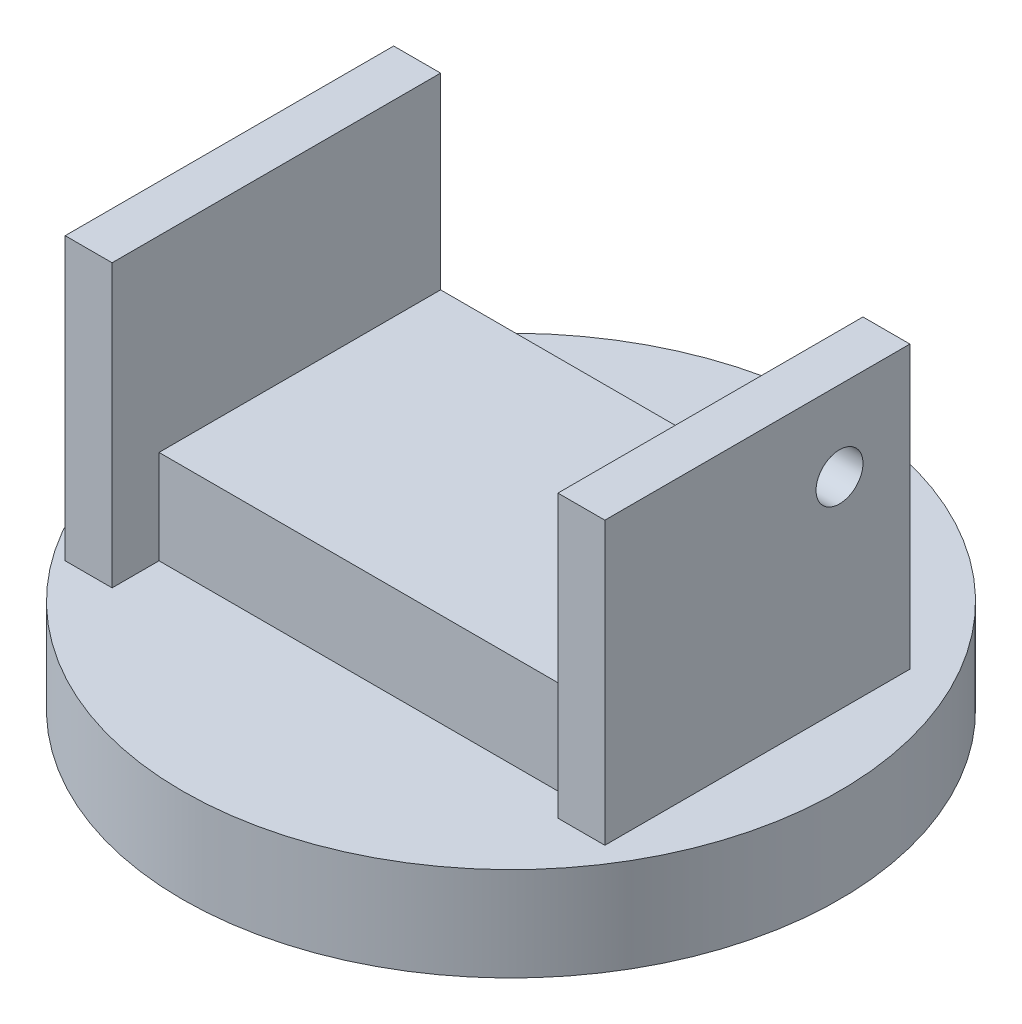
from build123d import *

# Parameters (mm, degrees)
SKETCH_1_R          = 35
EXTRUDE_1_DEPTH     = 10
SKETCH_2_W          = 45
SKETCH_2_H          = 30
EXTRUDE_2_DEPTH     = 10
SKETCH_3_W          = 5
SKETCH_3_H          = 35
EXTRUDE_3_DEPTH     = 30
SKETCH_4_W          = 5
SKETCH_4_H          = 32.5
EXTRUDE_4_DEPTH     = 30
SKETCH_5_R          = 2.4
EXTRUDE_5_DEPTH     = 5
SKETCH_6_R          = 2.5
CUT_EXTRUDE_1_DEPTH = 5


with BuildPart() as part:
    # Sketch 1 → Extrude 1 (new body)
    with BuildSketch(Plane(origin=(0, 0, 0), x_dir=(1, 0, 0), z_dir=(0, 1, 0))):
        with Locations(Location((0, 0, 0), (0, 0, 270))):
            Circle(SKETCH_1_R)
    extrude(amount=EXTRUDE_1_DEPTH)

    # Sketch 2 → Extrude 2 (add)
    with BuildSketch(Plane(origin=(0, 10, 0), x_dir=(1, 0, 0), z_dir=(0, 1, 0))):
        Rectangle(SKETCH_2_W, SKETCH_2_H)
    extrude(amount=EXTRUDE_2_DEPTH)

    # Sketch 3 → Extrude 3 (add)
    with BuildSketch(Plane(origin=(0, 10, 0), x_dir=(1, 0, 0), z_dir=(0, 1, 0))):
        with Locations((-25, -2.5)):
            Rectangle(SKETCH_3_W, SKETCH_3_H)
    extrude(amount=EXTRUDE_3_DEPTH)

    # Sketch 4 → Extrude 4 (add)
    with BuildSketch(Plane(origin=(0, 10, 0), x_dir=(1, 0, 0), z_dir=(0, 1, 0))):
        with Locations((25, -1.25)):
            Rectangle(SKETCH_4_W, SKETCH_4_H)
    extrude(amount=EXTRUDE_4_DEPTH)

    # Sketch 5 → Extrude 5 (add)
    with BuildSketch(Plane.ZY.offset(27.5)):
        with Locations(Location((-7.5, 31.5, 0), (0, 0, 180))):
            Circle(SKETCH_5_R)
    extrude(amount=EXTRUDE_5_DEPTH)

    # Sketch 6 → Cut-Extrude 1 (cut)
    with BuildSketch(Plane(origin=(27.5, 0, 0), x_dir=(0, 0, -1), z_dir=(1, 0, 0))):
        with Locations((7.5, 31.5)):
            Circle(SKETCH_6_R)
    extrude(amount=-CUT_EXTRUDE_1_DEPTH, mode=Mode.SUBTRACT)


solid = part.part
